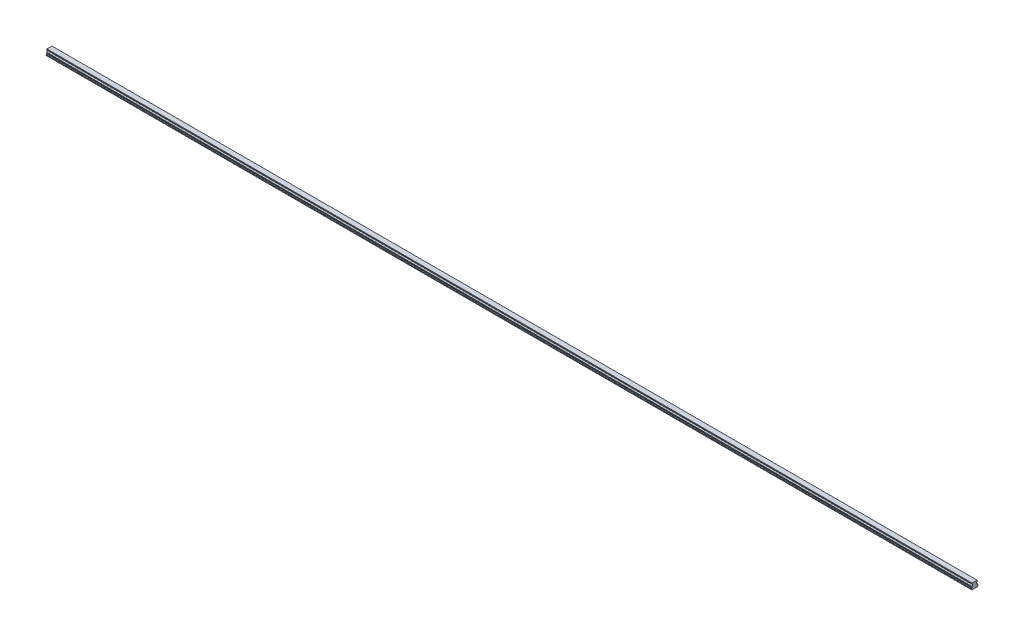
from build123d import *

# Parameters (mm, degrees)
BOSS_EXTRUDE1_DEPTH        = 3420
SKETCH3_R                  = 3
SKETCH3_R_2                = 2.5
CUT_EXTRUDE3_DEPTH         = 12
SKETCH3_2_R                = 2.5
CUT_EXTRUDE4_DEPTH         = 15
CHAMFER1_SIZE              = 0.5
LPATTERN4_COUNT            = 57
LPATTERN4_PITCH            = 60
CHAMFER1_OF_LPATTERN4_SIZE = 0.5


with BuildPart() as part:
    # Sketch1 → Boss-Extrude1 (new body)
    with BuildSketch(Plane(origin=(0, 0, 0), x_dir=(0, 0, -1), z_dir=(1, 0, 0))):
        with BuildLine():
            Line((9.375, 21.8), (-9.375, 21.8))
            Line((-9.375, 21.8), (-9.375, 20.756))
            Line((-9.375, 20.756), (-10, 19.415683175))
            Line((-10, 19.415683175), (-10, 17.685449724))
            ThreePointArc((-10, 17.685449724), (-7.2, 14.6), (-10, 11.514550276))
            Line((-10, 11.514550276), (-10, 9.784316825))
            Line((-10, 9.784316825), (-9.375, 8.444))
            Line((-9.375, 8.444), (-9.922688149, 6.4))
            Line((-9.922688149, 6.4), (-12.5, 5.489338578))
            Line((-12.5, 5.489338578), (-12.5, 2.65))
            Line((-12.5, 2.65), (-9.85, 0))
            Line((-9.85, 0), (-5.5, 0))
            Line((-5.5, 0), (-5, 0.5))
            Line((-5, 0.5), (5, 0.5))
            Line((5, 0.5), (5.5, 0))
            Line((5.5, 0), (9.85, 0))
            Line((9.85, 0), (12.5, 2.65))
            Line((12.5, 2.65), (12.5, 5.489338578))
            Line((12.5, 5.489338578), (9.922688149, 6.4))
            Line((9.922688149, 6.4), (9.375, 8.444))
            Line((9.375, 8.444), (10, 9.784316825))
            Line((10, 9.784316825), (10, 11.514550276))
            ThreePointArc((10, 11.514550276), (7.2, 14.6), (10, 17.685449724))
            Line((10, 17.685449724), (10, 19.415683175))
            Line((10, 19.415683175), (9.375, 20.756))
            Line((9.375, 20.756), (9.375, 21.8))
        make_face()
    extrude(amount=BOSS_EXTRUDE1_DEPTH)

    # Sketch3 → Cut-Extrude3 (cut)
    with BuildSketch(Plane.XZ):
        with Locations(Location((30, 0, 0), (0, 0, 270))):
            Circle(SKETCH3_R)
        with Locations(Location((30, 0, 0), (0, 0, 270))):
            Circle(SKETCH3_R_2, mode=Mode.SUBTRACT)
    cut_extrude3 = extrude(amount=-CUT_EXTRUDE3_DEPTH, mode=Mode.SUBTRACT)

    # Sketch3_2 → Cut-Extrude4 (cut)
    with BuildSketch(Plane.XZ):
        with Locations(Location((30, 0, 0), (0, 0, 270))):
            Circle(SKETCH3_2_R)
    cut_extrude4 = extrude(amount=-CUT_EXTRUDE4_DEPTH, mode=Mode.SUBTRACT)

    # Cut-Extrude5 cone 1 section (on through the dimple's axis) → Cut-Extrude5 (revolve, cut)
    with BuildSketch(Plane(origin=(30, 15, 0), x_dir=(0, 0, -1), z_dir=(1, 0, 0))):
        Polygon((0, 0), (2.5, 0), (0, 1.443375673), align=None)
    cut_extrude5 = revolve(axis=Axis((30, 15, 0), (0, 1, 0)), mode=Mode.SUBTRACT)

    # Chamfer1
    chamfer1_edges = [part.edges().sort_by_distance(p)[0] for p in [
        (30, 0.5, 3),
    ]]
    chamfer(chamfer1_edges, length=CHAMFER1_SIZE)

    # LPattern4: Cut-Extrude3, Cut-Extrude4, Cut-Extrude5 ×57
    with Locations(*[(i * LPATTERN4_PITCH, 0, 0) for i in range(1, LPATTERN4_COUNT)]):
        add(cut_extrude3, mode=Mode.SUBTRACT)
        add(cut_extrude4, mode=Mode.SUBTRACT)
        add(cut_extrude5, mode=Mode.SUBTRACT)

    # Chamfer1 of LPattern4
    chamfer1_of_lpattern4_edges = [part.edges().sort_by_distance(p)[0] for p in [
        (90, 0.5, 3),
        (150, 0.5, 3),
        (210, 0.5, 3),
        (270, 0.5, 3),
        (330, 0.5, 3),
        (390, 0.5, 3),
        (450, 0.5, 3),
        (510, 0.5, 3),
        (570, 0.5, 3),
        (630, 0.5, 3),
        (690, 0.5, 3),
        (750, 0.5, 3),
        (810, 0.5, 3),
        (870, 0.5, 3),
        (930, 0.5, 3),
        (990, 0.5, 3),
        (1050, 0.5, 3),
        (1110, 0.5, 3),
        (1170, 0.5, 3),
        (1230, 0.5, 3),
        (1290, 0.5, 3),
        (1350, 0.5, 3),
        (1410, 0.5, 3),
        (1470, 0.5, 3),
        (1530, 0.5, 3),
        (1590, 0.5, 3),
        (1650, 0.5, 3),
        (1710, 0.5, 3),
        (1770, 0.5, 3),
        (1830, 0.5, 3),
        (1890, 0.5, 3),
        (1950, 0.5, 3),
        (2010, 0.5, 3),
        (2070, 0.5, 3),
        (2130, 0.5, 3),
        (2190, 0.5, 3),
        (2250, 0.5, 3),
        (2310, 0.5, 3),
        (2370, 0.5, 3),
        (2430, 0.5, 3),
        (2490, 0.5, 3),
        (2550, 0.5, 3),
        (2610, 0.5, 3),
        (2670, 0.5, 3),
        (2730, 0.5, 3),
        (2790, 0.5, 3),
        (2850, 0.5, 3),
        (2910, 0.5, 3),
        (2970, 0.5, 3),
        (3030, 0.5, 3),
        (3090, 0.5, 3),
        (3150, 0.5, 3),
        (3210, 0.5, 3),
        (3270, 0.5, 3),
        (3330, 0.5, 3),
        (3390, 0.5, 3),
    ]]
    chamfer(chamfer1_of_lpattern4_edges, length=CHAMFER1_OF_LPATTERN4_SIZE)


solid = part.part
